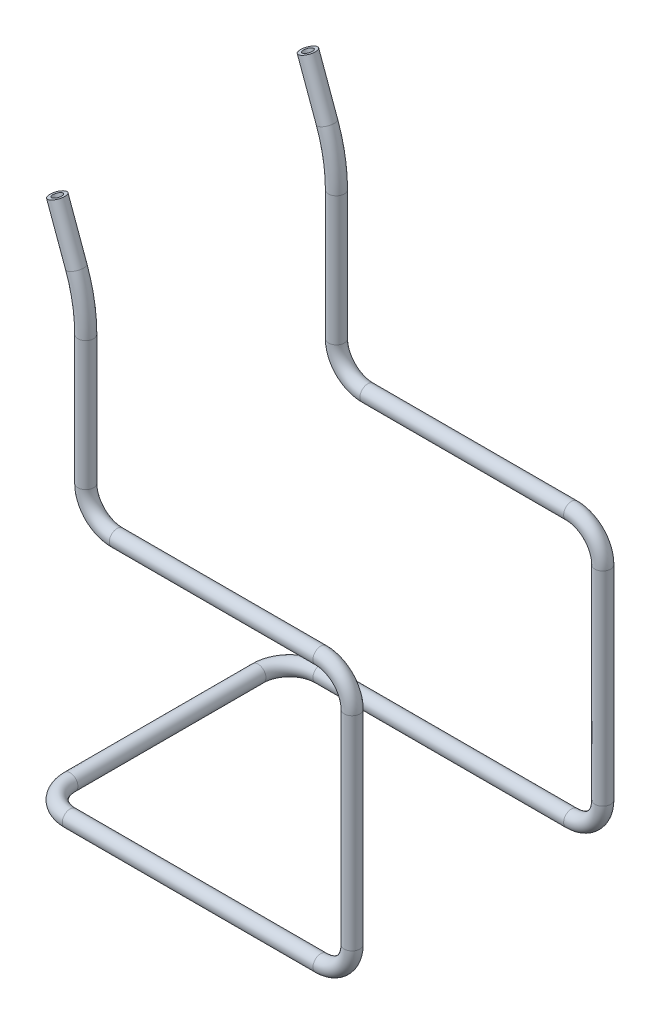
from build123d import *

# Parameters (mm, degrees)
SKETCH1_R   = 2.5
SKETCH1_R_2 = 1.5


with BuildPart() as part:
    # Sweep-Thin1: sweep along a curve in space
    with BuildLine() as sweep_thin1_path:
        Line((0, 0, 0), (0, 0, 30))
        ThreePointArc((0, 0, 30), (2.928932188, 0, 37.071067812), (10, 0, 40))
        Line((10, 0, 40), (90, 0, 40))
        ThreePointArc((90, 0, 40), (97.071067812, 2.928932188, 40), (100, 10, 40))
        Line((100, 10, 40), (100, 75, 40))
        ThreePointArc((100, 75, 40), (97.071067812, 82.071067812, 40), (90, 85, 40))
        Line((90, 85, 40), (25, 85, 40))
        ThreePointArc((25, 85, 40), (17.928932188, 87.928932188, 40), (15, 95, 40))
        Line((15, 95, 40), (15, 136.183650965, 40))
        ThreePointArc((15, 136.183650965, 40), (14.240387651, 144.866059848, 40), (11.984631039, 153.284658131, 40))
        Line((11.984631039, 153.284658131, 40), (5.900744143, 170, 40))
    # Sketch1 → Sweep-Thin1 (sweep)
    with BuildSketch(Plane.XY):
        Circle(SKETCH1_R)
        Circle(SKETCH1_R_2, mode=Mode.SUBTRACT)
    sweep_thin1 = sweep(path=sweep_thin1_path.line)

    # Mirror1: Sweep-Thin1 across plane
    add(sweep_thin1.mirror(Plane.XY))


solid = part.part
